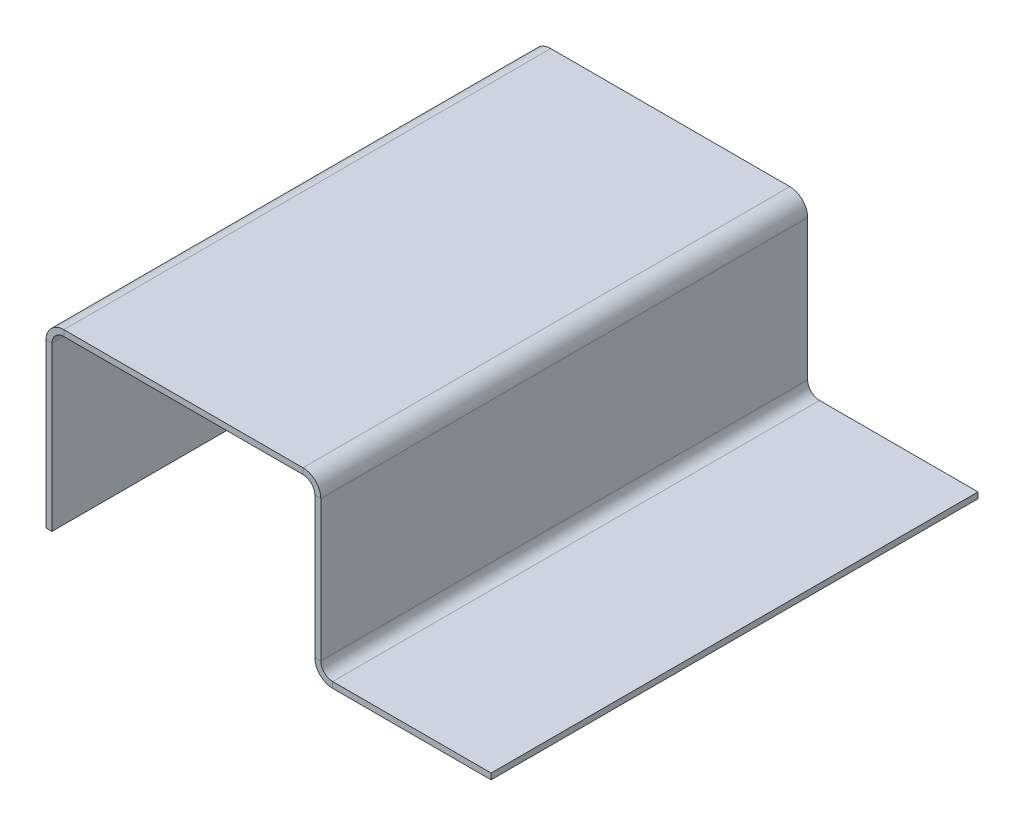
ISO-10303-21;
HEADER;
FILE_DESCRIPTION(('STEP AP214'),'2;1');
FILE_NAME('part.step','',(''),(''),'','','');
FILE_SCHEMA(('AUTOMOTIVE_DESIGN { 1 0 10303 214 1 1 1 1 }'));
ENDSEC;
DATA;
#1=APPLICATION_CONTEXT('core data for automotive mechanical design processes');
#2=APPLICATION_PROTOCOL_DEFINITION('international standard','automotive_design',2000,#1);
#3=PRODUCT_CONTEXT('',#1,'mechanical');
#4=PRODUCT('Part','Part','',(#3));
#5=PRODUCT_RELATED_PRODUCT_CATEGORY('part','',(#4));
#6=PRODUCT_DEFINITION_FORMATION('','',#4);
#7=PRODUCT_DEFINITION_CONTEXT('part definition',#1,'design');
#8=PRODUCT_DEFINITION('design','',#6,#7);
#9=PRODUCT_DEFINITION_SHAPE('','',#8);
#10=(LENGTH_UNIT() NAMED_UNIT(*) SI_UNIT(.MILLI.,.METRE.));
#11=(NAMED_UNIT(*) PLANE_ANGLE_UNIT() SI_UNIT($,.RADIAN.));
#12=(NAMED_UNIT(*) SI_UNIT($,.STERADIAN.) SOLID_ANGLE_UNIT());
#13=UNCERTAINTY_MEASURE_WITH_UNIT(LENGTH_MEASURE(1.E-05),#10,'distance_accuracy_value','');
#14=(GEOMETRIC_REPRESENTATION_CONTEXT(3) GLOBAL_UNCERTAINTY_ASSIGNED_CONTEXT((#13)) GLOBAL_UNIT_ASSIGNED_CONTEXT((#10,
#11,#12)) REPRESENTATION_CONTEXT('',''));
#15=CARTESIAN_POINT('',(0.,0.,0.));
#16=DIRECTION('',(0.,0.,1.));
#17=DIRECTION('',(1.,0.,0.));
#18=AXIS2_PLACEMENT_3D('',#15,#16,#17);
#19=CARTESIAN_POINT('',(172.933502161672,0.,41.));
#20=DIRECTION('',(0.,1.,0.));
#21=DIRECTION('',(-1.,0.,0.));
#22=AXIS2_PLACEMENT_3D('',#19,#20,#21);
#23=PLANE('',#22);
#24=DIRECTION('',(0.,0.,-1.));
#25=VECTOR('',#24,1.);
#26=CARTESIAN_POINT('',(0.,0.,41.));
#27=LINE('',#26,#25);
#28=CARTESIAN_POINT('',(0.,0.,41.));
#29=VERTEX_POINT('',#28);
#30=CARTESIAN_POINT('',(0.,0.,-41.));
#31=VERTEX_POINT('',#30);
#32=EDGE_CURVE('E218',#29,#31,#27,.T.);
#33=ORIENTED_EDGE('',*,*,#32,.T.);
#34=DIRECTION('',(-1.,0.,0.));
#35=VECTOR('',#34,1.);
#36=CARTESIAN_POINT('',(172.933502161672,0.,-41.));
#37=LINE('',#36,#35);
#38=CARTESIAN_POINT('',(1.,0.,-41.));
#39=VERTEX_POINT('',#38);
#40=EDGE_CURVE('E206',#39,#31,#37,.T.);
#41=ORIENTED_EDGE('',*,*,#40,.F.);
#42=DIRECTION('',(0.,0.,-1.));
#43=VECTOR('',#42,1.);
#44=CARTESIAN_POINT('',(0.999999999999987,0.,41.));
#45=LINE('',#44,#43);
#46=CARTESIAN_POINT('',(0.999999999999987,0.,41.));
#47=VERTEX_POINT('',#46);
#48=EDGE_CURVE('E11',#47,#39,#45,.T.);
#49=ORIENTED_EDGE('',*,*,#48,.F.);
#50=DIRECTION('',(-1.,0.,0.));
#51=VECTOR('',#50,1.);
#52=CARTESIAN_POINT('',(172.933502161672,0.,41.));
#53=LINE('',#52,#51);
#54=EDGE_CURVE('E215',#47,#29,#53,.T.);
#55=ORIENTED_EDGE('',*,*,#54,.T.);
#56=EDGE_LOOP('',(#33,#41,#49,#55));
#57=FACE_BOUND('',#56,.T.);
#58=ADVANCED_FACE('F32',(#57),#23,.F.);
#59=CARTESIAN_POINT('',(172.933502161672,0.,41.));
#60=DIRECTION('',(0.,0.,1.));
#61=DIRECTION('',(0.,1.,0.));
#62=AXIS2_PLACEMENT_3D('',#59,#60,#61);
#63=PLANE('',#62);
#64=DIRECTION('',(-1.,0.,0.));
#65=VECTOR('',#64,1.);
#66=CARTESIAN_POINT('',(172.933502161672,27.4317159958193,41.));
#67=LINE('',#66,#65);
#68=CARTESIAN_POINT('',(0.99999999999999,27.4317159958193,41.));
#69=VERTEX_POINT('',#68);
#70=CARTESIAN_POINT('',(0.,27.4317159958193,41.));
#71=VERTEX_POINT('',#70);
#72=EDGE_CURVE('E189',#69,#71,#67,.T.);
#73=ORIENTED_EDGE('',*,*,#72,.T.);
#74=DIRECTION('',(0.,1.,0.));
#75=VECTOR('',#74,1.);
#76=CARTESIAN_POINT('',(0.,0.,41.));
#77=LINE('',#76,#75);
#78=EDGE_CURVE('E210',#29,#71,#77,.T.);
#79=ORIENTED_EDGE('',*,*,#78,.F.);
#80=ORIENTED_EDGE('',*,*,#54,.F.);
#81=DIRECTION('',(0.,1.,0.));
#82=VECTOR('',#81,1.);
#83=CARTESIAN_POINT('',(0.999999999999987,0.,41.));
#84=LINE('',#83,#82);
#85=EDGE_CURVE('E212',#47,#69,#84,.T.);
#86=ORIENTED_EDGE('',*,*,#85,.T.);
#87=EDGE_LOOP('',(#73,#79,#80,#86));
#88=FACE_BOUND('',#87,.T.);
#89=ADVANCED_FACE('F381',(#88),#63,.T.);
#90=CARTESIAN_POINT('',(0.,0.,41.));
#91=DIRECTION('',(-1.,0.,0.));
#92=DIRECTION('',(0.,0.,1.));
#93=AXIS2_PLACEMENT_3D('',#90,#91,#92);
#94=PLANE('',#93);
#95=DIRECTION('',(0.,0.,1.));
#96=VECTOR('',#95,1.);
#97=CARTESIAN_POINT('',(0.,27.4317159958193,41.));
#98=LINE('',#97,#96);
#99=CARTESIAN_POINT('',(0.,27.4317159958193,-41.));
#100=VERTEX_POINT('',#99);
#101=EDGE_CURVE('E220',#100,#71,#98,.T.);
#102=ORIENTED_EDGE('',*,*,#101,.F.);
#103=DIRECTION('',(0.,1.,0.));
#104=VECTOR('',#103,1.);
#105=CARTESIAN_POINT('',(0.,0.,-41.));
#106=LINE('',#105,#104);
#107=EDGE_CURVE('E208',#31,#100,#106,.T.);
#108=ORIENTED_EDGE('',*,*,#107,.F.);
#109=ORIENTED_EDGE('',*,*,#32,.F.);
#110=ORIENTED_EDGE('',*,*,#78,.T.);
#111=EDGE_LOOP('',(#102,#108,#109,#110));
#112=FACE_BOUND('',#111,.T.);
#113=ADVANCED_FACE('F387',(#112),#94,.T.);
#114=CARTESIAN_POINT('',(172.933502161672,0.,-41.));
#115=DIRECTION('',(0.,0.,1.));
#116=DIRECTION('',(0.,1.,0.));
#117=AXIS2_PLACEMENT_3D('',#114,#115,#116);
#118=PLANE('',#117);
#119=ORIENTED_EDGE('',*,*,#107,.T.);
#120=DIRECTION('',(-1.,0.,0.));
#121=VECTOR('',#120,1.);
#122=CARTESIAN_POINT('',(172.933502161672,27.4317159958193,-41.));
#123=LINE('',#122,#121);
#124=CARTESIAN_POINT('',(0.99999999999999,27.4317159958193,-41.));
#125=VERTEX_POINT('',#124);
#126=EDGE_CURVE('E36',#125,#100,#123,.T.);
#127=ORIENTED_EDGE('',*,*,#126,.F.);
#128=DIRECTION('',(0.,1.,0.));
#129=VECTOR('',#128,1.);
#130=CARTESIAN_POINT('',(0.999999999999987,0.,-41.));
#131=LINE('',#130,#129);
#132=EDGE_CURVE('E66',#39,#125,#131,.T.);
#133=ORIENTED_EDGE('',*,*,#132,.F.);
#134=ORIENTED_EDGE('',*,*,#40,.T.);
#135=EDGE_LOOP('',(#119,#127,#133,#134));
#136=FACE_BOUND('',#135,.T.);
#137=ADVANCED_FACE('F394',(#136),#118,.F.);
#138=CARTESIAN_POINT('',(0.999999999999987,0.,41.));
#139=DIRECTION('',(-1.,0.,0.));
#140=DIRECTION('',(0.,0.,1.));
#141=AXIS2_PLACEMENT_3D('',#138,#139,#140);
#142=PLANE('',#141);
#143=ORIENTED_EDGE('',*,*,#132,.T.);
#144=DIRECTION('',(0.,0.,1.));
#145=VECTOR('',#144,1.);
#146=CARTESIAN_POINT('',(0.999999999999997,27.4317159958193,41.));
#147=LINE('',#146,#145);
#148=EDGE_CURVE('E42',#125,#69,#147,.T.);
#149=ORIENTED_EDGE('',*,*,#148,.T.);
#150=ORIENTED_EDGE('',*,*,#85,.F.);
#151=ORIENTED_EDGE('',*,*,#48,.T.);
#152=EDGE_LOOP('',(#143,#149,#150,#151));
#153=FACE_BOUND('',#152,.T.);
#154=ADVANCED_FACE('F34',(#153),#142,.F.);
#155=CARTESIAN_POINT('',(0.,-152.283439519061,41.));
#156=DIRECTION('',(0.,0.,1.));
#157=DIRECTION('',(1.,0.,0.));
#158=AXIS2_PLACEMENT_3D('',#155,#156,#157);
#159=PLANE('',#158);
#160=DIRECTION('',(0.,1.,0.));
#161=VECTOR('',#160,1.);
#162=CARTESIAN_POINT('',(43.2766311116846,-152.283439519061,41.));
#163=LINE('',#162,#161);
#164=CARTESIAN_POINT('',(43.2766311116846,29.4317159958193,41.));
#165=VERTEX_POINT('',#164);
#166=CARTESIAN_POINT('',(43.2766311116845,30.4317159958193,41.));
#167=VERTEX_POINT('',#166);
#168=EDGE_CURVE('E171',#165,#167,#163,.T.);
#169=ORIENTED_EDGE('',*,*,#168,.T.);
#170=DIRECTION('',(1.,0.,0.));
#171=VECTOR('',#170,1.);
#172=CARTESIAN_POINT('',(0.,30.4317159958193,41.));
#173=LINE('',#172,#171);
#174=CARTESIAN_POINT('',(3.,30.4317159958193,41.));
#175=VERTEX_POINT('',#174);
#176=EDGE_CURVE('E178',#175,#167,#173,.T.);
#177=ORIENTED_EDGE('',*,*,#176,.F.);
#178=DIRECTION('',(0.,1.,0.));
#179=VECTOR('',#178,1.);
#180=CARTESIAN_POINT('',(2.99999999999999,-152.283439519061,41.));
#181=LINE('',#180,#179);
#182=CARTESIAN_POINT('',(3.,29.4317159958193,41.));
#183=VERTEX_POINT('',#182);
#184=EDGE_CURVE('E174',#183,#175,#181,.T.);
#185=ORIENTED_EDGE('',*,*,#184,.F.);
#186=DIRECTION('',(1.,0.,0.));
#187=VECTOR('',#186,1.);
#188=CARTESIAN_POINT('',(0.,29.4317159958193,41.));
#189=LINE('',#188,#187);
#190=EDGE_CURVE('E100',#183,#165,#189,.T.);
#191=ORIENTED_EDGE('',*,*,#190,.T.);
#192=EDGE_LOOP('',(#169,#177,#185,#191));
#193=FACE_BOUND('',#192,.T.);
#194=ADVANCED_FACE('F176',(#193),#159,.T.);
#195=CARTESIAN_POINT('',(0.,30.4317159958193,41.));
#196=DIRECTION('',(0.,1.,0.));
#197=DIRECTION('',(0.,0.,1.));
#198=AXIS2_PLACEMENT_3D('',#195,#196,#197);
#199=PLANE('',#198);
#200=DIRECTION('',(1.,0.,0.));
#201=VECTOR('',#200,1.);
#202=CARTESIAN_POINT('',(0.,30.4317159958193,-41.));
#203=LINE('',#202,#201);
#204=CARTESIAN_POINT('',(3.,30.4317159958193,-41.));
#205=VERTEX_POINT('',#204);
#206=CARTESIAN_POINT('',(43.2766311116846,30.4317159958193,-41.));
#207=VERTEX_POINT('',#206);
#208=EDGE_CURVE('E235',#205,#207,#203,.T.);
#209=ORIENTED_EDGE('',*,*,#208,.F.);
#210=DIRECTION('',(0.,0.,1.));
#211=VECTOR('',#210,1.);
#212=CARTESIAN_POINT('',(3.,30.4317159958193,41.));
#213=LINE('',#212,#211);
#214=EDGE_CURVE('E170',#205,#175,#213,.T.);
#215=ORIENTED_EDGE('',*,*,#214,.T.);
#216=ORIENTED_EDGE('',*,*,#176,.T.);
#217=DIRECTION('',(0.,0.,1.));
#218=VECTOR('',#217,1.);
#219=CARTESIAN_POINT('',(43.2766311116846,30.4317159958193,41.));
#220=LINE('',#219,#218);
#221=EDGE_CURVE('E196',#207,#167,#220,.T.);
#222=ORIENTED_EDGE('',*,*,#221,.F.);
#223=EDGE_LOOP('',(#209,#215,#216,#222));
#224=FACE_BOUND('',#223,.T.);
#225=ADVANCED_FACE('F240',(#224),#199,.T.);
#226=CARTESIAN_POINT('',(0.,-152.283439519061,-41.));
#227=DIRECTION('',(0.,0.,1.));
#228=DIRECTION('',(1.,0.,0.));
#229=AXIS2_PLACEMENT_3D('',#226,#227,#228);
#230=PLANE('',#229);
#231=ORIENTED_EDGE('',*,*,#208,.T.);
#232=DIRECTION('',(0.,1.,0.));
#233=VECTOR('',#232,1.);
#234=CARTESIAN_POINT('',(43.2766311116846,-152.283439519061,-41.));
#235=LINE('',#234,#233);
#236=CARTESIAN_POINT('',(43.2766311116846,29.4317159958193,-41.));
#237=VERTEX_POINT('',#236);
#238=EDGE_CURVE('E94',#237,#207,#235,.T.);
#239=ORIENTED_EDGE('',*,*,#238,.F.);
#240=DIRECTION('',(1.,0.,0.));
#241=VECTOR('',#240,1.);
#242=CARTESIAN_POINT('',(0.,29.4317159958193,-41.));
#243=LINE('',#242,#241);
#244=CARTESIAN_POINT('',(3.,29.4317159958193,-41.));
#245=VERTEX_POINT('',#244);
#246=EDGE_CURVE('E78',#245,#237,#243,.T.);
#247=ORIENTED_EDGE('',*,*,#246,.F.);
#248=DIRECTION('',(0.,1.,0.));
#249=VECTOR('',#248,1.);
#250=CARTESIAN_POINT('',(2.99999999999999,-152.283439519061,-41.));
#251=LINE('',#250,#249);
#252=EDGE_CURVE('E229',#245,#205,#251,.T.);
#253=ORIENTED_EDGE('',*,*,#252,.T.);
#254=EDGE_LOOP('',(#231,#239,#247,#253));
#255=FACE_BOUND('',#254,.T.);
#256=ADVANCED_FACE('F451',(#255),#230,.F.);
#257=CARTESIAN_POINT('',(0.,29.4317159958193,41.));
#258=DIRECTION('',(0.,1.,0.));
#259=DIRECTION('',(0.,0.,1.));
#260=AXIS2_PLACEMENT_3D('',#257,#258,#259);
#261=PLANE('',#260);
#262=DIRECTION('',(0.,0.,1.));
#263=VECTOR('',#262,1.);
#264=CARTESIAN_POINT('',(3.,29.4317159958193,41.));
#265=LINE('',#264,#263);
#266=EDGE_CURVE('E166',#245,#183,#265,.T.);
#267=ORIENTED_EDGE('',*,*,#266,.F.);
#268=ORIENTED_EDGE('',*,*,#246,.T.);
#269=DIRECTION('',(0.,0.,1.));
#270=VECTOR('',#269,1.);
#271=CARTESIAN_POINT('',(43.2766311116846,29.4317159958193,41.));
#272=LINE('',#271,#270);
#273=EDGE_CURVE('E169',#237,#165,#272,.T.);
#274=ORIENTED_EDGE('',*,*,#273,.T.);
#275=ORIENTED_EDGE('',*,*,#190,.F.);
#276=EDGE_LOOP('',(#267,#268,#274,#275));
#277=FACE_BOUND('',#276,.T.);
#278=ADVANCED_FACE('F164',(#277),#261,.F.);
#279=CARTESIAN_POINT('',(216.980529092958,30.4317159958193,41.));
#280=DIRECTION('',(0.,0.,-1.));
#281=DIRECTION('',(0.,1.,0.));
#282=AXIS2_PLACEMENT_3D('',#279,#280,#281);
#283=PLANE('',#282);
#284=DIRECTION('',(-1.,0.,0.));
#285=VECTOR('',#284,1.);
#286=CARTESIAN_POINT('',(216.980529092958,27.4317159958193,41.));
#287=LINE('',#286,#285);
#288=CARTESIAN_POINT('',(46.2766311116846,27.4317159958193,41.));
#289=VERTEX_POINT('',#288);
#290=CARTESIAN_POINT('',(45.2766311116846,27.4317159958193,41.));
#291=VERTEX_POINT('',#290);
#292=EDGE_CURVE('E246',#289,#291,#287,.T.);
#293=ORIENTED_EDGE('',*,*,#292,.T.);
#294=DIRECTION('',(0.,1.,0.));
#295=VECTOR('',#294,1.);
#296=CARTESIAN_POINT('',(45.2766311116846,30.4317159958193,41.));
#297=LINE('',#296,#295);
#298=CARTESIAN_POINT('',(45.2766311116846,3.74722325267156,41.));
#299=VERTEX_POINT('',#298);
#300=EDGE_CURVE('E275',#291,#299,#297,.F.);
#301=ORIENTED_EDGE('',*,*,#300,.T.);
#302=DIRECTION('',(-1.,0.,0.));
#303=VECTOR('',#302,1.);
#304=CARTESIAN_POINT('',(216.980529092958,3.74722325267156,41.));
#305=LINE('',#304,#303);
#306=CARTESIAN_POINT('',(46.2766311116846,3.74722325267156,40.9999999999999));
#307=VERTEX_POINT('',#306);
#308=EDGE_CURVE('E324',#307,#299,#305,.T.);
#309=ORIENTED_EDGE('',*,*,#308,.F.);
#310=DIRECTION('',(0.,-1.,0.));
#311=VECTOR('',#310,1.);
#312=CARTESIAN_POINT('',(46.2766311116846,30.4317159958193,41.));
#313=LINE('',#312,#311);
#314=EDGE_CURVE('E313',#289,#307,#313,.T.);
#315=ORIENTED_EDGE('',*,*,#314,.F.);
#316=EDGE_LOOP('',(#293,#301,#309,#315));
#317=FACE_BOUND('',#316,.T.);
#318=ADVANCED_FACE('F351',(#317),#283,.F.);
#319=CARTESIAN_POINT('',(216.980529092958,30.4317159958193,-41.));
#320=DIRECTION('',(0.,0.,-1.));
#321=DIRECTION('',(0.,1.,0.));
#322=AXIS2_PLACEMENT_3D('',#319,#320,#321);
#323=PLANE('',#322);
#324=DIRECTION('',(0.,-1.,0.));
#325=VECTOR('',#324,1.);
#326=CARTESIAN_POINT('',(45.2766311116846,30.4317159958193,-41.));
#327=LINE('',#326,#325);
#328=CARTESIAN_POINT('',(45.2766311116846,27.4317159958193,-41.));
#329=VERTEX_POINT('',#328);
#330=CARTESIAN_POINT('',(45.2766311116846,3.74722325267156,-41.));
#331=VERTEX_POINT('',#330);
#332=EDGE_CURVE('E202',#329,#331,#327,.T.);
#333=ORIENTED_EDGE('',*,*,#332,.F.);
#334=DIRECTION('',(-1.,0.,0.));
#335=VECTOR('',#334,1.);
#336=CARTESIAN_POINT('',(216.980529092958,27.4317159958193,-41.));
#337=LINE('',#336,#335);
#338=CARTESIAN_POINT('',(46.2766311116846,27.4317159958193,-41.));
#339=VERTEX_POINT('',#338);
#340=EDGE_CURVE('E319',#339,#329,#337,.T.);
#341=ORIENTED_EDGE('',*,*,#340,.F.);
#342=DIRECTION('',(0.,-1.,0.));
#343=VECTOR('',#342,1.);
#344=CARTESIAN_POINT('',(46.2766311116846,30.4317159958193,-41.));
#345=LINE('',#344,#343);
#346=CARTESIAN_POINT('',(46.2766311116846,3.74722325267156,-41.));
#347=VERTEX_POINT('',#346);
#348=EDGE_CURVE('E326',#339,#347,#345,.T.);
#349=ORIENTED_EDGE('',*,*,#348,.T.);
#350=DIRECTION('',(-1.,0.,0.));
#351=VECTOR('',#350,1.);
#352=CARTESIAN_POINT('',(216.980529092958,3.74722325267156,-41.));
#353=LINE('',#352,#351);
#354=EDGE_CURVE('E321',#347,#331,#353,.T.);
#355=ORIENTED_EDGE('',*,*,#354,.T.);
#356=EDGE_LOOP('',(#333,#341,#349,#355));
#357=FACE_BOUND('',#356,.T.);
#358=ADVANCED_FACE('F335',(#357),#323,.T.);
#359=CARTESIAN_POINT('',(46.2766311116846,30.4317159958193,41.));
#360=DIRECTION('',(1.,0.,0.));
#361=DIRECTION('',(0.,0.,-1.));
#362=AXIS2_PLACEMENT_3D('',#359,#360,#361);
#363=PLANE('',#362);
#364=DIRECTION('',(0.,0.,-1.));
#365=VECTOR('',#364,1.);
#366=CARTESIAN_POINT('',(46.2766311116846,27.4317159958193,41.));
#367=LINE('',#366,#365);
#368=EDGE_CURVE('E255',#289,#339,#367,.T.);
#369=ORIENTED_EDGE('',*,*,#368,.F.);
#370=ORIENTED_EDGE('',*,*,#314,.T.);
#371=DIRECTION('',(0.,0.,1.));
#372=VECTOR('',#371,1.);
#373=CARTESIAN_POINT('',(46.2766311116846,3.74722325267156,-41.));
#374=LINE('',#373,#372);
#375=EDGE_CURVE('E316',#347,#307,#374,.T.);
#376=ORIENTED_EDGE('',*,*,#375,.F.);
#377=ORIENTED_EDGE('',*,*,#348,.F.);
#378=EDGE_LOOP('',(#369,#370,#376,#377));
#379=FACE_BOUND('',#378,.T.);
#380=ADVANCED_FACE('F347',(#379),#363,.T.);
#381=CARTESIAN_POINT('',(45.2766311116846,30.4317159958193,41.));
#382=DIRECTION('',(1.,0.,0.));
#383=DIRECTION('',(0.,0.,-1.));
#384=AXIS2_PLACEMENT_3D('',#381,#382,#383);
#385=PLANE('',#384);
#386=ORIENTED_EDGE('',*,*,#300,.F.);
#387=DIRECTION('',(0.,0.,-1.));
#388=VECTOR('',#387,1.);
#389=CARTESIAN_POINT('',(45.2766311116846,27.4317159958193,41.));
#390=LINE('',#389,#388);
#391=EDGE_CURVE('E310',#291,#329,#390,.T.);
#392=ORIENTED_EDGE('',*,*,#391,.T.);
#393=ORIENTED_EDGE('',*,*,#332,.T.);
#394=DIRECTION('',(0.,0.,1.));
#395=VECTOR('',#394,1.);
#396=CARTESIAN_POINT('',(45.2766311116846,3.74722325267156,-41.));
#397=LINE('',#396,#395);
#398=EDGE_CURVE('E307',#331,#299,#397,.T.);
#399=ORIENTED_EDGE('',*,*,#398,.T.);
#400=EDGE_LOOP('',(#386,#392,#393,#399));
#401=FACE_BOUND('',#400,.T.);
#402=ADVANCED_FACE('F334',(#401),#385,.F.);
#403=CARTESIAN_POINT('',(74.9611238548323,174.212433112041,41.));
#404=DIRECTION('',(-1.,0.,0.));
#405=DIRECTION('',(0.,0.,1.));
#406=AXIS2_PLACEMENT_3D('',#403,#404,#405);
#407=PLANE('',#406);
#408=DIRECTION('',(0.,-1.,0.));
#409=VECTOR('',#408,1.);
#410=CARTESIAN_POINT('',(74.9611238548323,174.212433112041,41.));
#411=LINE('',#410,#409);
#412=CARTESIAN_POINT('',(74.9611238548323,1.74722325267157,41.));
#413=VERTEX_POINT('',#412);
#414=CARTESIAN_POINT('',(74.9611238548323,0.747223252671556,41.));
#415=VERTEX_POINT('',#414);
#416=EDGE_CURVE('E299',#413,#415,#411,.T.);
#417=ORIENTED_EDGE('',*,*,#416,.T.);
#418=DIRECTION('',(0.,0.,-1.));
#419=VECTOR('',#418,1.);
#420=CARTESIAN_POINT('',(74.9611238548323,0.747223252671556,41.));
#421=LINE('',#420,#419);
#422=CARTESIAN_POINT('',(74.9611238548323,0.747223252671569,-41.));
#423=VERTEX_POINT('',#422);
#424=EDGE_CURVE('E296',#415,#423,#421,.T.);
#425=ORIENTED_EDGE('',*,*,#424,.T.);
#426=DIRECTION('',(0.,-1.,0.));
#427=VECTOR('',#426,1.);
#428=CARTESIAN_POINT('',(74.9611238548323,174.212433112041,-41.));
#429=LINE('',#428,#427);
#430=CARTESIAN_POINT('',(74.9611238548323,1.74722325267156,-41.));
#431=VERTEX_POINT('',#430);
#432=EDGE_CURVE('E272',#431,#423,#429,.T.);
#433=ORIENTED_EDGE('',*,*,#432,.F.);
#434=DIRECTION('',(0.,0.,-1.));
#435=VECTOR('',#434,1.);
#436=CARTESIAN_POINT('',(74.9611238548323,1.74722325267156,41.));
#437=LINE('',#436,#435);
#438=EDGE_CURVE('E287',#413,#431,#437,.T.);
#439=ORIENTED_EDGE('',*,*,#438,.F.);
#440=EDGE_LOOP('',(#417,#425,#433,#439));
#441=FACE_BOUND('',#440,.T.);
#442=ADVANCED_FACE('F370',(#441),#407,.F.);
#443=CARTESIAN_POINT('',(46.2766311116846,1.74722325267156,41.));
#444=DIRECTION('',(0.,1.,0.));
#445=DIRECTION('',(0.,0.,1.));
#446=AXIS2_PLACEMENT_3D('',#443,#444,#445);
#447=PLANE('',#446);
#448=DIRECTION('',(1.,0.,0.));
#449=VECTOR('',#448,1.);
#450=CARTESIAN_POINT('',(46.2766311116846,1.74722325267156,-41.));
#451=LINE('',#450,#449);
#452=CARTESIAN_POINT('',(48.2766311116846,1.74722325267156,-41.));
#453=VERTEX_POINT('',#452);
#454=EDGE_CURVE('E276',#453,#431,#451,.T.);
#455=ORIENTED_EDGE('',*,*,#454,.F.);
#456=DIRECTION('',(0.,0.,1.));
#457=VECTOR('',#456,1.);
#458=CARTESIAN_POINT('',(48.2766311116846,1.74722325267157,-41.));
#459=LINE('',#458,#457);
#460=CARTESIAN_POINT('',(48.2766311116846,1.74722325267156,40.9999999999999));
#461=VERTEX_POINT('',#460);
#462=EDGE_CURVE('E293',#453,#461,#459,.T.);
#463=ORIENTED_EDGE('',*,*,#462,.T.);
#464=DIRECTION('',(1.,0.,0.));
#465=VECTOR('',#464,1.);
#466=CARTESIAN_POINT('',(46.2766311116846,1.74722325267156,41.));
#467=LINE('',#466,#465);
#468=EDGE_CURVE('E290',#461,#413,#467,.T.);
#469=ORIENTED_EDGE('',*,*,#468,.T.);
#470=ORIENTED_EDGE('',*,*,#438,.T.);
#471=EDGE_LOOP('',(#455,#463,#469,#470));
#472=FACE_BOUND('',#471,.T.);
#473=ADVANCED_FACE('F361',(#472),#447,.T.);
#474=CARTESIAN_POINT('',(46.2766311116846,174.212433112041,41.));
#475=DIRECTION('',(0.,0.,-1.));
#476=DIRECTION('',(-1.,0.,0.));
#477=AXIS2_PLACEMENT_3D('',#474,#475,#476);
#478=PLANE('',#477);
#479=DIRECTION('',(0.,-1.,0.));
#480=VECTOR('',#479,1.);
#481=CARTESIAN_POINT('',(48.2766311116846,174.212433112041,41.));
#482=LINE('',#481,#480);
#483=CARTESIAN_POINT('',(48.2766311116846,0.747223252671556,41.));
#484=VERTEX_POINT('',#483);
#485=EDGE_CURVE('E284',#461,#484,#482,.T.);
#486=ORIENTED_EDGE('',*,*,#485,.T.);
#487=DIRECTION('',(1.,0.,0.));
#488=VECTOR('',#487,1.);
#489=CARTESIAN_POINT('',(46.2766311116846,0.747223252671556,41.));
#490=LINE('',#489,#488);
#491=EDGE_CURVE('E281',#484,#415,#490,.T.);
#492=ORIENTED_EDGE('',*,*,#491,.T.);
#493=ORIENTED_EDGE('',*,*,#416,.F.);
#494=ORIENTED_EDGE('',*,*,#468,.F.);
#495=EDGE_LOOP('',(#486,#492,#493,#494));
#496=FACE_BOUND('',#495,.T.);
#497=ADVANCED_FACE('F358',(#496),#478,.F.);
#498=CARTESIAN_POINT('',(46.2766311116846,0.747223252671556,41.));
#499=DIRECTION('',(0.,1.,0.));
#500=DIRECTION('',(0.,0.,1.));
#501=AXIS2_PLACEMENT_3D('',#498,#499,#500);
#502=PLANE('',#501);
#503=DIRECTION('',(0.,0.,1.));
#504=VECTOR('',#503,1.);
#505=CARTESIAN_POINT('',(48.2766311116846,0.747223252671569,-41.));
#506=LINE('',#505,#504);
#507=CARTESIAN_POINT('',(48.2766311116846,0.747223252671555,-41.));
#508=VERTEX_POINT('',#507);
#509=EDGE_CURVE('E302',#508,#484,#506,.T.);
#510=ORIENTED_EDGE('',*,*,#509,.F.);
#511=DIRECTION('',(1.,0.,0.));
#512=VECTOR('',#511,1.);
#513=CARTESIAN_POINT('',(46.2766311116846,0.747223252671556,-41.));
#514=LINE('',#513,#512);
#515=EDGE_CURVE('E279',#508,#423,#514,.T.);
#516=ORIENTED_EDGE('',*,*,#515,.T.);
#517=ORIENTED_EDGE('',*,*,#424,.F.);
#518=ORIENTED_EDGE('',*,*,#491,.F.);
#519=EDGE_LOOP('',(#510,#516,#517,#518));
#520=FACE_BOUND('',#519,.T.);
#521=ADVANCED_FACE('F368',(#520),#502,.F.);
#522=CARTESIAN_POINT('',(46.2766311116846,174.212433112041,-41.));
#523=DIRECTION('',(0.,0.,-1.));
#524=DIRECTION('',(-1.,0.,0.));
#525=AXIS2_PLACEMENT_3D('',#522,#523,#524);
#526=PLANE('',#525);
#527=ORIENTED_EDGE('',*,*,#515,.F.);
#528=DIRECTION('',(0.,-1.,0.));
#529=VECTOR('',#528,1.);
#530=CARTESIAN_POINT('',(48.2766311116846,174.212433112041,-41.));
#531=LINE('',#530,#529);
#532=EDGE_CURVE('E271',#453,#508,#531,.T.);
#533=ORIENTED_EDGE('',*,*,#532,.F.);
#534=ORIENTED_EDGE('',*,*,#454,.T.);
#535=ORIENTED_EDGE('',*,*,#432,.T.);
#536=EDGE_LOOP('',(#527,#533,#534,#535));
#537=FACE_BOUND('',#536,.T.);
#538=ADVANCED_FACE('F364',(#537),#526,.T.);
#539=CARTESIAN_POINT('',(48.2766311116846,3.74722325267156,41.));
#540=DIRECTION('',(0.,0.,1.));
#541=DIRECTION('',(1.,0.,0.));
#542=AXIS2_PLACEMENT_3D('',#539,#540,#541);
#543=PLANE('',#542);
#544=ORIENTED_EDGE('',*,*,#485,.F.);
#545=CARTESIAN_POINT('',(48.2766311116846,3.74722325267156,40.9999999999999));
#546=DIRECTION('',(0.,0.,1.));
#547=DIRECTION('',(1.,0.,0.));
#548=AXIS2_PLACEMENT_3D('',#545,#546,#547);
#549=CIRCLE('',#548,2.);
#550=EDGE_CURVE('E264',#461,#307,#549,.F.);
#551=ORIENTED_EDGE('',*,*,#550,.T.);
#552=ORIENTED_EDGE('',*,*,#308,.T.);
#553=CARTESIAN_POINT('',(48.2766311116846,3.74722325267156,41.));
#554=DIRECTION('',(0.,0.,-1.));
#555=DIRECTION('',(-1.,0.,0.));
#556=AXIS2_PLACEMENT_3D('',#553,#554,#555);
#557=CIRCLE('',#556,3.);
#558=EDGE_CURVE('E116',#484,#299,#557,.T.);
#559=ORIENTED_EDGE('',*,*,#558,.F.);
#560=EDGE_LOOP('',(#544,#551,#552,#559));
#561=FACE_BOUND('',#560,.T.);
#562=ADVANCED_FACE('F353',(#561),#543,.T.);
#563=CARTESIAN_POINT('',(48.2766311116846,3.74722325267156,-41.));
#564=DIRECTION('',(0.,0.,-1.));
#565=DIRECTION('',(-1.,0.,0.));
#566=AXIS2_PLACEMENT_3D('',#563,#564,#565);
#567=PLANE('',#566);
#568=ORIENTED_EDGE('',*,*,#354,.F.);
#569=CARTESIAN_POINT('',(48.2766311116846,3.74722325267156,-41.));
#570=DIRECTION('',(0.,0.,1.));
#571=DIRECTION('',(1.,0.,0.));
#572=AXIS2_PLACEMENT_3D('',#569,#570,#571);
#573=CIRCLE('',#572,2.);
#574=EDGE_CURVE('E249',#347,#453,#573,.T.);
#575=ORIENTED_EDGE('',*,*,#574,.T.);
#576=ORIENTED_EDGE('',*,*,#532,.T.);
#577=CARTESIAN_POINT('',(48.2766311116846,3.74722325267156,-41.));
#578=DIRECTION('',(0.,0.,1.));
#579=DIRECTION('',(1.,0.,0.));
#580=AXIS2_PLACEMENT_3D('',#577,#578,#579);
#581=CIRCLE('',#580,3.);
#582=EDGE_CURVE('E267',#331,#508,#581,.T.);
#583=ORIENTED_EDGE('',*,*,#582,.F.);
#584=EDGE_LOOP('',(#568,#575,#576,#583));
#585=FACE_BOUND('',#584,.T.);
#586=ADVANCED_FACE('F339',(#585),#567,.T.);
#587=CARTESIAN_POINT('',(48.2766311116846,3.74722325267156,-196.581727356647));
#588=DIRECTION('',(0.,0.,1.));
#589=DIRECTION('',(1.,0.,0.));
#590=AXIS2_PLACEMENT_3D('',#587,#588,#589);
#591=CYLINDRICAL_SURFACE('',#590,3.);
#592=ORIENTED_EDGE('',*,*,#582,.T.);
#593=ORIENTED_EDGE('',*,*,#509,.T.);
#594=ORIENTED_EDGE('',*,*,#558,.T.);
#595=ORIENTED_EDGE('',*,*,#398,.F.);
#596=EDGE_LOOP('',(#592,#593,#594,#595));
#597=FACE_BOUND('',#596,.T.);
#598=ADVANCED_FACE('F366',(#597),#591,.T.);
#599=CARTESIAN_POINT('',(48.2766311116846,3.74722325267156,-196.581727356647));
#600=DIRECTION('',(0.,0.,1.));
#601=DIRECTION('',(1.,0.,0.));
#602=AXIS2_PLACEMENT_3D('',#599,#600,#601);
#603=CYLINDRICAL_SURFACE('',#602,2.);
#604=ORIENTED_EDGE('',*,*,#574,.F.);
#605=ORIENTED_EDGE('',*,*,#375,.T.);
#606=ORIENTED_EDGE('',*,*,#550,.F.);
#607=ORIENTED_EDGE('',*,*,#462,.F.);
#608=EDGE_LOOP('',(#604,#605,#606,#607));
#609=FACE_BOUND('',#608,.T.);
#610=ADVANCED_FACE('F343',(#609),#603,.F.);
#611=CARTESIAN_POINT('',(43.2766311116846,27.4317159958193,41.));
#612=DIRECTION('',(0.,0.,-1.));
#613=DIRECTION('',(-1.,0.,0.));
#614=AXIS2_PLACEMENT_3D('',#611,#612,#613);
#615=PLANE('',#614);
#616=ORIENTED_EDGE('',*,*,#168,.F.);
#617=CARTESIAN_POINT('',(43.2766311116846,27.4317159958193,41.));
#618=DIRECTION('',(0.,0.,-1.));
#619=DIRECTION('',(-1.,0.,0.));
#620=AXIS2_PLACEMENT_3D('',#617,#618,#619);
#621=CIRCLE('',#620,2.);
#622=EDGE_CURVE('E108',#291,#165,#621,.F.);
#623=ORIENTED_EDGE('',*,*,#622,.F.);
#624=ORIENTED_EDGE('',*,*,#292,.F.);
#625=CARTESIAN_POINT('',(43.2766311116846,27.4317159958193,41.));
#626=DIRECTION('',(0.,0.,1.));
#627=DIRECTION('',(1.,0.,0.));
#628=AXIS2_PLACEMENT_3D('',#625,#626,#627);
#629=CIRCLE('',#628,3.);
#630=EDGE_CURVE('E243',#289,#167,#629,.T.);
#631=ORIENTED_EDGE('',*,*,#630,.T.);
#632=EDGE_LOOP('',(#616,#623,#624,#631));
#633=FACE_BOUND('',#632,.T.);
#634=ADVANCED_FACE('F244',(#633),#615,.F.);
#635=CARTESIAN_POINT('',(43.2766311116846,27.4317159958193,-41.));
#636=DIRECTION('',(0.,0.,1.));
#637=DIRECTION('',(1.,0.,0.));
#638=AXIS2_PLACEMENT_3D('',#635,#636,#637);
#639=PLANE('',#638);
#640=ORIENTED_EDGE('',*,*,#340,.T.);
#641=CARTESIAN_POINT('',(43.2766311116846,27.4317159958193,-41.));
#642=DIRECTION('',(0.,0.,-1.));
#643=DIRECTION('',(-1.,0.,0.));
#644=AXIS2_PLACEMENT_3D('',#641,#642,#643);
#645=CIRCLE('',#644,2.);
#646=EDGE_CURVE('E259',#237,#329,#645,.T.);
#647=ORIENTED_EDGE('',*,*,#646,.F.);
#648=ORIENTED_EDGE('',*,*,#238,.T.);
#649=CARTESIAN_POINT('',(43.2766311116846,27.4317159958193,-41.));
#650=DIRECTION('',(0.,0.,-1.));
#651=DIRECTION('',(-1.,0.,0.));
#652=AXIS2_PLACEMENT_3D('',#649,#650,#651);
#653=CIRCLE('',#652,3.);
#654=EDGE_CURVE('E250',#207,#339,#653,.T.);
#655=ORIENTED_EDGE('',*,*,#654,.T.);
#656=EDGE_LOOP('',(#640,#647,#648,#655));
#657=FACE_BOUND('',#656,.T.);
#658=ADVANCED_FACE('F415',(#657),#639,.F.);
#659=CARTESIAN_POINT('',(43.2766311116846,27.4317159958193,176.584906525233));
#660=DIRECTION('',(0.,0.,-1.));
#661=DIRECTION('',(-1.,0.,0.));
#662=AXIS2_PLACEMENT_3D('',#659,#660,#661);
#663=CYLINDRICAL_SURFACE('',#662,3.);
#664=ORIENTED_EDGE('',*,*,#654,.F.);
#665=ORIENTED_EDGE('',*,*,#221,.T.);
#666=ORIENTED_EDGE('',*,*,#630,.F.);
#667=ORIENTED_EDGE('',*,*,#368,.T.);
#668=EDGE_LOOP('',(#664,#665,#666,#667));
#669=FACE_BOUND('',#668,.T.);
#670=ADVANCED_FACE('F253',(#669),#663,.T.);
#671=CARTESIAN_POINT('',(43.2766311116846,27.4317159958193,176.584906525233));
#672=DIRECTION('',(0.,0.,-1.));
#673=DIRECTION('',(-1.,0.,0.));
#674=AXIS2_PLACEMENT_3D('',#671,#672,#673);
#675=CYLINDRICAL_SURFACE('',#674,2.);
#676=ORIENTED_EDGE('',*,*,#646,.T.);
#677=ORIENTED_EDGE('',*,*,#391,.F.);
#678=ORIENTED_EDGE('',*,*,#622,.T.);
#679=ORIENTED_EDGE('',*,*,#273,.F.);
#680=EDGE_LOOP('',(#676,#677,#678,#679));
#681=FACE_BOUND('',#680,.T.);
#682=ADVANCED_FACE('F414',(#681),#675,.F.);
#683=CARTESIAN_POINT('',(3.,27.4317159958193,41.));
#684=DIRECTION('',(0.,0.,1.));
#685=DIRECTION('',(1.,0.,0.));
#686=AXIS2_PLACEMENT_3D('',#683,#684,#685);
#687=PLANE('',#686);
#688=ORIENTED_EDGE('',*,*,#72,.F.);
#689=CARTESIAN_POINT('',(3.,27.4317159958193,41.));
#690=DIRECTION('',(0.,0.,-1.));
#691=DIRECTION('',(-1.,0.,0.));
#692=AXIS2_PLACEMENT_3D('',#689,#690,#691);
#693=CIRCLE('',#692,2.);
#694=EDGE_CURVE('E186',#69,#183,#693,.T.);
#695=ORIENTED_EDGE('',*,*,#694,.T.);
#696=ORIENTED_EDGE('',*,*,#184,.T.);
#697=CARTESIAN_POINT('',(3.,27.4317159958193,41.));
#698=DIRECTION('',(0.,0.,-1.));
#699=DIRECTION('',(-1.,0.,0.));
#700=AXIS2_PLACEMENT_3D('',#697,#698,#699);
#701=CIRCLE('',#700,3.);
#702=EDGE_CURVE('E406',#71,#175,#701,.T.);
#703=ORIENTED_EDGE('',*,*,#702,.F.);
#704=EDGE_LOOP('',(#688,#695,#696,#703));
#705=FACE_BOUND('',#704,.T.);
#706=ADVANCED_FACE('F187',(#705),#687,.T.);
#707=CARTESIAN_POINT('',(3.,27.4317159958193,-41.));
#708=DIRECTION('',(0.,0.,-1.));
#709=DIRECTION('',(-1.,0.,0.));
#710=AXIS2_PLACEMENT_3D('',#707,#708,#709);
#711=PLANE('',#710);
#712=CARTESIAN_POINT('',(3.,27.4317159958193,-40.9999999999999));
#713=DIRECTION('',(0.,0.,-1.));
#714=DIRECTION('',(-1.,0.,0.));
#715=AXIS2_PLACEMENT_3D('',#712,#713,#714);
#716=CIRCLE('',#715,2.);
#717=EDGE_CURVE('E191',#245,#125,#716,.F.);
#718=ORIENTED_EDGE('',*,*,#717,.T.);
#719=ORIENTED_EDGE('',*,*,#126,.T.);
#720=CARTESIAN_POINT('',(3.,27.4317159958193,-41.));
#721=DIRECTION('',(0.,0.,1.));
#722=DIRECTION('',(1.,0.,0.));
#723=AXIS2_PLACEMENT_3D('',#720,#721,#722);
#724=CIRCLE('',#723,3.);
#725=EDGE_CURVE('E408',#205,#100,#724,.T.);
#726=ORIENTED_EDGE('',*,*,#725,.F.);
#727=ORIENTED_EDGE('',*,*,#252,.F.);
#728=EDGE_LOOP('',(#718,#719,#726,#727));
#729=FACE_BOUND('',#728,.T.);
#730=ADVANCED_FACE('F405',(#729),#711,.T.);
#731=CARTESIAN_POINT('',(3.,27.4317159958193,176.805256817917));
#732=DIRECTION('',(0.,0.,-1.));
#733=DIRECTION('',(-1.,0.,0.));
#734=AXIS2_PLACEMENT_3D('',#731,#732,#733);
#735=CYLINDRICAL_SURFACE('',#734,3.);
#736=ORIENTED_EDGE('',*,*,#214,.F.);
#737=ORIENTED_EDGE('',*,*,#725,.T.);
#738=ORIENTED_EDGE('',*,*,#101,.T.);
#739=ORIENTED_EDGE('',*,*,#702,.T.);
#740=EDGE_LOOP('',(#736,#737,#738,#739));
#741=FACE_BOUND('',#740,.T.);
#742=ADVANCED_FACE('F456',(#741),#735,.T.);
#743=CARTESIAN_POINT('',(3.,27.4317159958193,176.805256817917));
#744=DIRECTION('',(0.,0.,-1.));
#745=DIRECTION('',(-1.,0.,0.));
#746=AXIS2_PLACEMENT_3D('',#743,#744,#745);
#747=CYLINDRICAL_SURFACE('',#746,2.);
#748=ORIENTED_EDGE('',*,*,#266,.T.);
#749=ORIENTED_EDGE('',*,*,#694,.F.);
#750=ORIENTED_EDGE('',*,*,#148,.F.);
#751=ORIENTED_EDGE('',*,*,#717,.F.);
#752=EDGE_LOOP('',(#748,#749,#750,#751));
#753=FACE_BOUND('',#752,.T.);
#754=ADVANCED_FACE('F194',(#753),#747,.F.);
#755=CLOSED_SHELL('',(#58,#89,#113,#137,#154,#194,#225,#256,#278,#318,#358,#380,#402,#442,#473,
#497,#521,#538,#562,#586,#598,#610,#634,#658,#670,#682,#706,#730,#742,#754));
#756=MANIFOLD_SOLID_BREP('B2',#755);
#757=ADVANCED_BREP_SHAPE_REPRESENTATION('',(#18,#756),#14);
#758=SHAPE_DEFINITION_REPRESENTATION(#9,#757);
ENDSEC;
END-ISO-10303-21;
